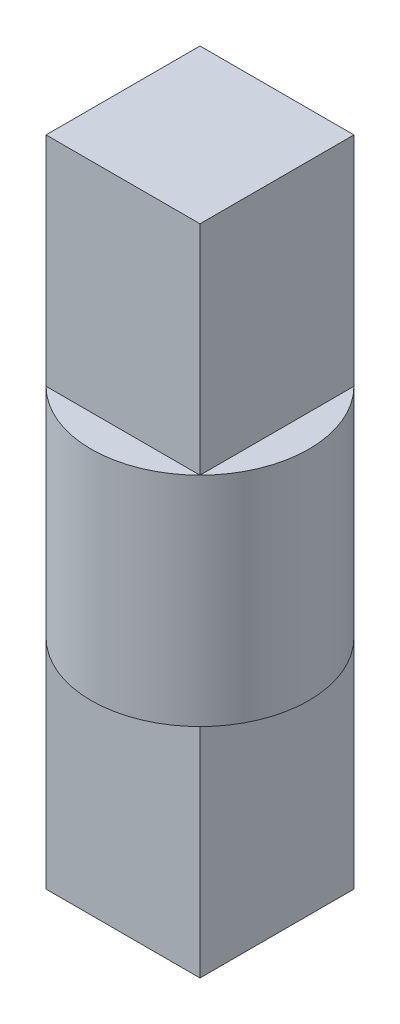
from build123d import *

# Parameters (mm, degrees)
BOSS_EXTRUDE1_DEPTH      = 1.5
BOSS_EXTRUDE1_DEPTH_BACK = 1.5
SKETCH1_W                = 0.707106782
SKETCH1_H                = 0.707106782
BOSS_EXTRUDE2_DEPTH      = 0.5
BOSS_EXTRUDE2_DEPTH_BACK = 0.5
SKETCH2_R                = 0.5


with BuildPart() as part:
    # Sketch1 → Boss-Extrude1 (new, two sides: drawn at the far end of the back side and taken through both)
    with BuildSketch(Plane(origin=(0, 0, 0), x_dir=(1, 0, 0), z_dir=(0, 1, 0)).offset(-BOSS_EXTRUDE1_DEPTH_BACK)):
        Rectangle(SKETCH1_W, SKETCH1_H)
    extrude(amount=BOSS_EXTRUDE1_DEPTH + BOSS_EXTRUDE1_DEPTH_BACK)

    # Sketch2 → Boss-Extrude2 (add, two sides: drawn at the far end of the back side and taken through both)
    with BuildSketch(Plane(origin=(0, 0, 0), x_dir=(1, 0, 0), z_dir=(0, 1, 0)).offset(-BOSS_EXTRUDE2_DEPTH_BACK)):
        with Locations(Location((0, 0, 0), (0, 0, 315))):
            Circle(SKETCH2_R)
    extrude(amount=BOSS_EXTRUDE2_DEPTH + BOSS_EXTRUDE2_DEPTH_BACK)


solid = part.part
